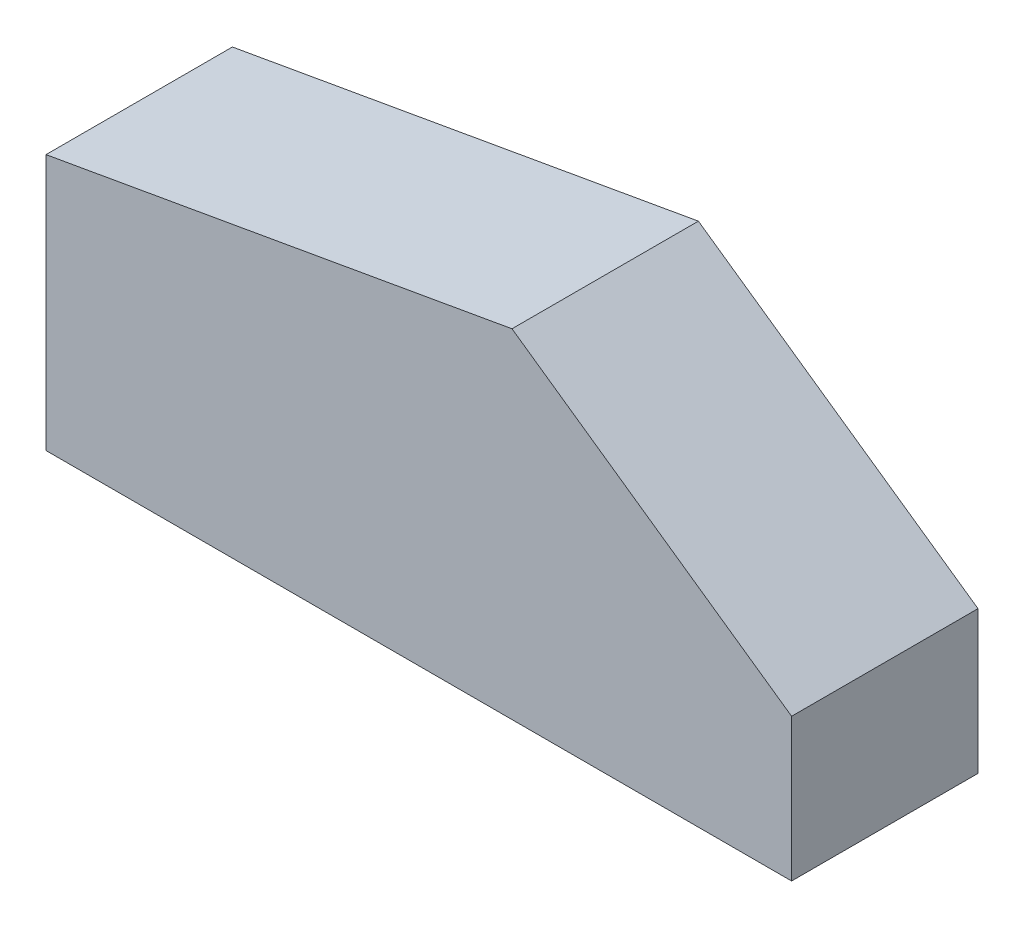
ISO-10303-21;
HEADER;
FILE_DESCRIPTION(('STEP AP214'),'2;1');
FILE_NAME('part.step','',(''),(''),'','','');
FILE_SCHEMA(('AUTOMOTIVE_DESIGN { 1 0 10303 214 1 1 1 1 }'));
ENDSEC;
DATA;
#1=APPLICATION_CONTEXT('core data for automotive mechanical design processes');
#2=APPLICATION_PROTOCOL_DEFINITION('international standard','automotive_design',2000,#1);
#3=PRODUCT_CONTEXT('',#1,'mechanical');
#4=PRODUCT('Part','Part','',(#3));
#5=PRODUCT_RELATED_PRODUCT_CATEGORY('part','',(#4));
#6=PRODUCT_DEFINITION_FORMATION('','',#4);
#7=PRODUCT_DEFINITION_CONTEXT('part definition',#1,'design');
#8=PRODUCT_DEFINITION('design','',#6,#7);
#9=PRODUCT_DEFINITION_SHAPE('','',#8);
#10=(LENGTH_UNIT() NAMED_UNIT(*) SI_UNIT(.MILLI.,.METRE.));
#11=(NAMED_UNIT(*) PLANE_ANGLE_UNIT() SI_UNIT($,.RADIAN.));
#12=(NAMED_UNIT(*) SI_UNIT($,.STERADIAN.) SOLID_ANGLE_UNIT());
#13=UNCERTAINTY_MEASURE_WITH_UNIT(LENGTH_MEASURE(1.E-05),#10,'distance_accuracy_value','');
#14=(GEOMETRIC_REPRESENTATION_CONTEXT(3) GLOBAL_UNCERTAINTY_ASSIGNED_CONTEXT((#13)) GLOBAL_UNIT_ASSIGNED_CONTEXT((#10,
#11,#12)) REPRESENTATION_CONTEXT('',''));
#15=CARTESIAN_POINT('',(0.,0.,0.));
#16=DIRECTION('',(0.,0.,1.));
#17=DIRECTION('',(1.,0.,0.));
#18=AXIS2_PLACEMENT_3D('',#15,#16,#17);
#19=CARTESIAN_POINT('',(0.,34.925,25.4));
#20=DIRECTION('',(1.,0.,0.));
#21=DIRECTION('',(0.,1.,0.));
#22=AXIS2_PLACEMENT_3D('',#19,#20,#21);
#23=PLANE('',#22);
#24=DIRECTION('',(0.,-1.,0.));
#25=VECTOR('',#24,1.);
#26=CARTESIAN_POINT('',(0.,34.925,0.));
#27=LINE('',#26,#25);
#28=CARTESIAN_POINT('',(0.,34.925,0.));
#29=VERTEX_POINT('',#28);
#30=CARTESIAN_POINT('',(0.,0.,0.));
#31=VERTEX_POINT('',#30);
#32=EDGE_CURVE('E78',#29,#31,#27,.T.);
#33=ORIENTED_EDGE('',*,*,#32,.T.);
#34=DIRECTION('',(0.,0.,-1.));
#35=VECTOR('',#34,1.);
#36=CARTESIAN_POINT('',(0.,0.,25.4));
#37=LINE('',#36,#35);
#38=CARTESIAN_POINT('',(0.,0.,25.4));
#39=VERTEX_POINT('',#38);
#40=EDGE_CURVE('E11',#39,#31,#37,.T.);
#41=ORIENTED_EDGE('',*,*,#40,.F.);
#42=DIRECTION('',(0.,-1.,0.));
#43=VECTOR('',#42,1.);
#44=CARTESIAN_POINT('',(0.,34.925,25.4));
#45=LINE('',#44,#43);
#46=CARTESIAN_POINT('',(0.,34.925,25.4));
#47=VERTEX_POINT('',#46);
#48=EDGE_CURVE('E99',#47,#39,#45,.T.);
#49=ORIENTED_EDGE('',*,*,#48,.F.);
#50=DIRECTION('',(0.,0.,-1.));
#51=VECTOR('',#50,1.);
#52=CARTESIAN_POINT('',(0.,34.925,25.4));
#53=LINE('',#52,#51);
#54=EDGE_CURVE('E91',#47,#29,#53,.T.);
#55=ORIENTED_EDGE('',*,*,#54,.T.);
#56=EDGE_LOOP('',(#33,#41,#49,#55));
#57=FACE_BOUND('',#56,.T.);
#58=ADVANCED_FACE('F28',(#57),#23,.F.);
#59=CARTESIAN_POINT('',(0.,0.,25.4));
#60=DIRECTION('',(0.,1.,0.));
#61=DIRECTION('',(0.,0.,1.));
#62=AXIS2_PLACEMENT_3D('',#59,#60,#61);
#63=PLANE('',#62);
#64=DIRECTION('',(1.,0.,0.));
#65=VECTOR('',#64,1.);
#66=CARTESIAN_POINT('',(0.,0.,0.));
#67=LINE('',#66,#65);
#68=CARTESIAN_POINT('',(101.6,0.,0.));
#69=VERTEX_POINT('',#68);
#70=EDGE_CURVE('E74',#31,#69,#67,.T.);
#71=ORIENTED_EDGE('',*,*,#70,.T.);
#72=DIRECTION('',(0.,0.,-1.));
#73=VECTOR('',#72,1.);
#74=CARTESIAN_POINT('',(101.6,0.,25.4));
#75=LINE('',#74,#73);
#76=CARTESIAN_POINT('',(101.6,0.,25.4));
#77=VERTEX_POINT('',#76);
#78=EDGE_CURVE('E35',#77,#69,#75,.T.);
#79=ORIENTED_EDGE('',*,*,#78,.F.);
#80=DIRECTION('',(1.,0.,0.));
#81=VECTOR('',#80,1.);
#82=CARTESIAN_POINT('',(0.,0.,25.4));
#83=LINE('',#82,#81);
#84=EDGE_CURVE('E87',#39,#77,#83,.T.);
#85=ORIENTED_EDGE('',*,*,#84,.F.);
#86=ORIENTED_EDGE('',*,*,#40,.T.);
#87=EDGE_LOOP('',(#71,#79,#85,#86));
#88=FACE_BOUND('',#87,.T.);
#89=ADVANCED_FACE('F86',(#88),#63,.F.);
#90=CARTESIAN_POINT('',(101.6,0.,25.4));
#91=DIRECTION('',(-1.,0.,0.));
#92=DIRECTION('',(0.,-1.,0.));
#93=AXIS2_PLACEMENT_3D('',#90,#91,#92);
#94=PLANE('',#93);
#95=DIRECTION('',(0.,1.,0.));
#96=VECTOR('',#95,1.);
#97=CARTESIAN_POINT('',(101.6,0.,0.));
#98=LINE('',#97,#96);
#99=CARTESIAN_POINT('',(101.6,19.4438560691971,0.));
#100=VERTEX_POINT('',#99);
#101=EDGE_CURVE('E80',#69,#100,#98,.T.);
#102=ORIENTED_EDGE('',*,*,#101,.T.);
#103=DIRECTION('',(0.,0.,-1.));
#104=VECTOR('',#103,1.);
#105=CARTESIAN_POINT('',(101.6,19.4438560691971,25.4));
#106=LINE('',#105,#104);
#107=CARTESIAN_POINT('',(101.6,19.4438560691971,25.4));
#108=VERTEX_POINT('',#107);
#109=EDGE_CURVE('E110',#108,#100,#106,.T.);
#110=ORIENTED_EDGE('',*,*,#109,.F.);
#111=DIRECTION('',(0.,1.,0.));
#112=VECTOR('',#111,1.);
#113=CARTESIAN_POINT('',(101.6,0.,25.4));
#114=LINE('',#113,#112);
#115=EDGE_CURVE('E102',#77,#108,#114,.T.);
#116=ORIENTED_EDGE('',*,*,#115,.F.);
#117=ORIENTED_EDGE('',*,*,#78,.T.);
#118=EDGE_LOOP('',(#102,#110,#116,#117));
#119=FACE_BOUND('',#118,.T.);
#120=ADVANCED_FACE('F114',(#119),#94,.F.);
#121=CARTESIAN_POINT('',(101.6,19.4438560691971,25.4));
#122=DIRECTION('',(-0.57357643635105,-0.819152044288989,0.));
#123=DIRECTION('',(0.819152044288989,-0.57357643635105,0.));
#124=AXIS2_PLACEMENT_3D('',#121,#122,#123);
#125=PLANE('',#124);
#126=DIRECTION('',(-0.819152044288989,0.57357643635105,0.));
#127=VECTOR('',#126,1.);
#128=CARTESIAN_POINT('',(101.6,19.4438560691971,0.));
#129=LINE('',#128,#127);
#130=CARTESIAN_POINT('',(63.5,46.1217632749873,0.));
#131=VERTEX_POINT('',#130);
#132=EDGE_CURVE('E95',#100,#131,#129,.T.);
#133=ORIENTED_EDGE('',*,*,#132,.T.);
#134=DIRECTION('',(0.,0.,-1.));
#135=VECTOR('',#134,1.);
#136=CARTESIAN_POINT('',(63.5,46.1217632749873,25.4));
#137=LINE('',#136,#135);
#138=CARTESIAN_POINT('',(63.5,46.1217632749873,25.4));
#139=VERTEX_POINT('',#138);
#140=EDGE_CURVE('E107',#139,#131,#137,.T.);
#141=ORIENTED_EDGE('',*,*,#140,.F.);
#142=DIRECTION('',(-0.819152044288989,0.57357643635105,0.));
#143=VECTOR('',#142,1.);
#144=CARTESIAN_POINT('',(101.6,19.4438560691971,25.4));
#145=LINE('',#144,#143);
#146=EDGE_CURVE('E47',#108,#139,#145,.T.);
#147=ORIENTED_EDGE('',*,*,#146,.F.);
#148=ORIENTED_EDGE('',*,*,#109,.T.);
#149=EDGE_LOOP('',(#133,#141,#147,#148));
#150=FACE_BOUND('',#149,.T.);
#151=ADVANCED_FACE('F125',(#150),#125,.F.);
#152=CARTESIAN_POINT('',(63.5,46.1217632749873,25.4));
#153=DIRECTION('',(0.173648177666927,-0.984807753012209,0.));
#154=DIRECTION('',(0.984807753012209,0.173648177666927,0.));
#155=AXIS2_PLACEMENT_3D('',#152,#153,#154);
#156=PLANE('',#155);
#157=DIRECTION('',(-0.984807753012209,-0.173648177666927,0.));
#158=VECTOR('',#157,1.);
#159=CARTESIAN_POINT('',(63.5,46.1217632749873,0.));
#160=LINE('',#159,#158);
#161=EDGE_CURVE('E97',#131,#29,#160,.T.);
#162=ORIENTED_EDGE('',*,*,#161,.T.);
#163=ORIENTED_EDGE('',*,*,#54,.F.);
#164=DIRECTION('',(-0.984807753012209,-0.173648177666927,0.));
#165=VECTOR('',#164,1.);
#166=CARTESIAN_POINT('',(63.5,46.1217632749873,25.4));
#167=LINE('',#166,#165);
#168=EDGE_CURVE('E42',#139,#47,#167,.T.);
#169=ORIENTED_EDGE('',*,*,#168,.F.);
#170=ORIENTED_EDGE('',*,*,#140,.T.);
#171=EDGE_LOOP('',(#162,#163,#169,#170));
#172=FACE_BOUND('',#171,.T.);
#173=ADVANCED_FACE('F118',(#172),#156,.F.);
#174=CARTESIAN_POINT('',(0.,0.,25.4));
#175=DIRECTION('',(0.,0.,1.));
#176=DIRECTION('',(1.,0.,0.));
#177=AXIS2_PLACEMENT_3D('',#174,#175,#176);
#178=PLANE('',#177);
#179=ORIENTED_EDGE('',*,*,#48,.T.);
#180=ORIENTED_EDGE('',*,*,#84,.T.);
#181=ORIENTED_EDGE('',*,*,#115,.T.);
#182=ORIENTED_EDGE('',*,*,#146,.T.);
#183=ORIENTED_EDGE('',*,*,#168,.T.);
#184=EDGE_LOOP('',(#179,#180,#181,#182,#183));
#185=FACE_BOUND('',#184,.T.);
#186=ADVANCED_FACE('F116',(#185),#178,.T.);
#187=CARTESIAN_POINT('',(0.,0.,0.));
#188=DIRECTION('',(0.,0.,1.));
#189=DIRECTION('',(1.,0.,0.));
#190=AXIS2_PLACEMENT_3D('',#187,#188,#189);
#191=PLANE('',#190);
#192=ORIENTED_EDGE('',*,*,#32,.F.);
#193=ORIENTED_EDGE('',*,*,#161,.F.);
#194=ORIENTED_EDGE('',*,*,#132,.F.);
#195=ORIENTED_EDGE('',*,*,#101,.F.);
#196=ORIENTED_EDGE('',*,*,#70,.F.);
#197=EDGE_LOOP('',(#192,#193,#194,#195,#196));
#198=FACE_BOUND('',#197,.T.);
#199=ADVANCED_FACE('F75',(#198),#191,.F.);
#200=CLOSED_SHELL('',(#58,#89,#120,#151,#173,#186,#199));
#201=MANIFOLD_SOLID_BREP('B2',#200);
#202=ADVANCED_BREP_SHAPE_REPRESENTATION('',(#18,#201),#14);
#203=SHAPE_DEFINITION_REPRESENTATION(#9,#202);
ENDSEC;
END-ISO-10303-21;
